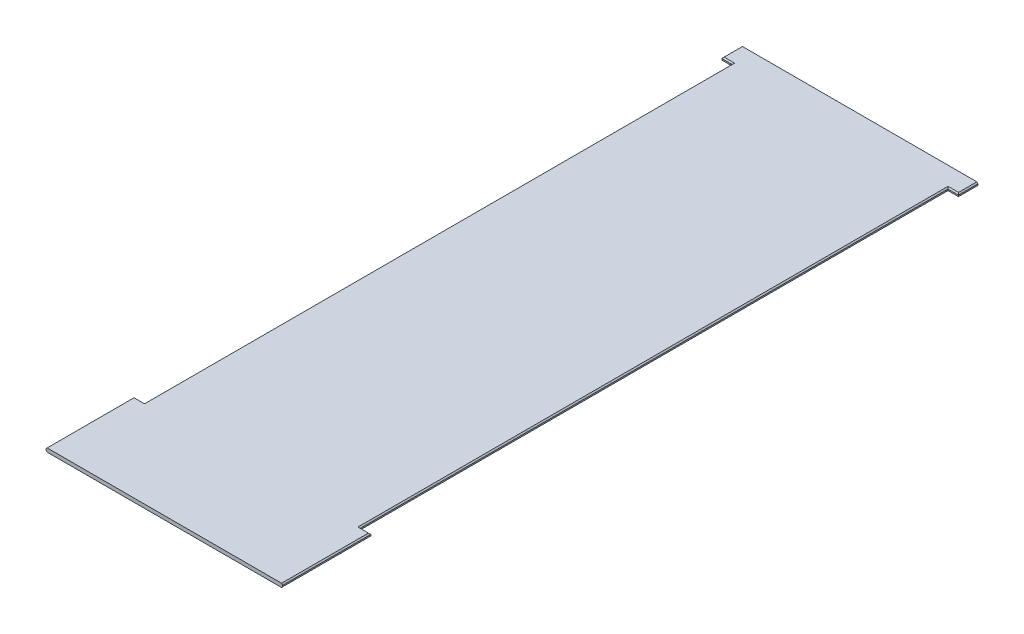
ISO-10303-21;
HEADER;
FILE_DESCRIPTION(('STEP AP214'),'2;1');
FILE_NAME('part.step','',(''),(''),'','','');
FILE_SCHEMA(('AUTOMOTIVE_DESIGN { 1 0 10303 214 1 1 1 1 }'));
ENDSEC;
DATA;
#1=APPLICATION_CONTEXT('core data for automotive mechanical design processes');
#2=APPLICATION_PROTOCOL_DEFINITION('international standard','automotive_design',2000,#1);
#3=PRODUCT_CONTEXT('',#1,'mechanical');
#4=PRODUCT('Part','Part','',(#3));
#5=PRODUCT_RELATED_PRODUCT_CATEGORY('part','',(#4));
#6=PRODUCT_DEFINITION_FORMATION('','',#4);
#7=PRODUCT_DEFINITION_CONTEXT('part definition',#1,'design');
#8=PRODUCT_DEFINITION('design','',#6,#7);
#9=PRODUCT_DEFINITION_SHAPE('','',#8);
#10=(LENGTH_UNIT() NAMED_UNIT(*) SI_UNIT(.MILLI.,.METRE.));
#11=(NAMED_UNIT(*) PLANE_ANGLE_UNIT() SI_UNIT($,.RADIAN.));
#12=(NAMED_UNIT(*) SI_UNIT($,.STERADIAN.) SOLID_ANGLE_UNIT());
#13=UNCERTAINTY_MEASURE_WITH_UNIT(LENGTH_MEASURE(1.E-05),#10,'distance_accuracy_value','');
#14=(GEOMETRIC_REPRESENTATION_CONTEXT(3) GLOBAL_UNCERTAINTY_ASSIGNED_CONTEXT((#13)) GLOBAL_UNIT_ASSIGNED_CONTEXT((#10,
#11,#12)) REPRESENTATION_CONTEXT('',''));
#15=CARTESIAN_POINT('',(0.,0.,0.));
#16=DIRECTION('',(0.,0.,1.));
#17=DIRECTION('',(1.,0.,0.));
#18=AXIS2_PLACEMENT_3D('',#15,#16,#17);
#19=CARTESIAN_POINT('',(553.261641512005,9.525,1566.92811259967));
#20=DIRECTION('',(-1.,0.,0.));
#21=DIRECTION('',(0.,0.,1.));
#22=AXIS2_PLACEMENT_3D('',#19,#20,#21);
#23=PLANE('',#22);
#24=DIRECTION('',(0.,-1.,0.));
#25=VECTOR('',#24,1.);
#26=CARTESIAN_POINT('',(553.261641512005,9.525,2018.12811259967));
#27=LINE('',#26,#25);
#28=CARTESIAN_POINT('',(553.261641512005,3.52500000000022,2018.12811259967));
#29=VERTEX_POINT('',#28);
#30=CARTESIAN_POINT('',(553.261641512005,-3.52499999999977,2018.12811259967));
#31=VERTEX_POINT('',#30);
#32=EDGE_CURVE('E236',#29,#31,#27,.T.);
#33=ORIENTED_EDGE('',*,*,#32,.T.);
#34=DIRECTION('',(0.,0.,-1.));
#35=VECTOR('',#34,1.);
#36=CARTESIAN_POINT('',(553.261641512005,-3.52499999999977,1566.92811259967));
#37=LINE('',#36,#35);
#38=CARTESIAN_POINT('',(553.261641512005,-3.52499999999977,1566.92811259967));
#39=VERTEX_POINT('',#38);
#40=EDGE_CURVE('E11',#31,#39,#37,.T.);
#41=ORIENTED_EDGE('',*,*,#40,.T.);
#42=DIRECTION('',(0.,-1.,0.));
#43=VECTOR('',#42,1.);
#44=CARTESIAN_POINT('',(553.261641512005,9.525,1566.92811259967));
#45=LINE('',#44,#43);
#46=CARTESIAN_POINT('',(553.261641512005,3.52500000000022,1566.92811259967));
#47=VERTEX_POINT('',#46);
#48=EDGE_CURVE('E243',#47,#39,#45,.T.);
#49=ORIENTED_EDGE('',*,*,#48,.F.);
#50=DIRECTION('',(0.,0.,1.));
#51=VECTOR('',#50,1.);
#52=CARTESIAN_POINT('',(553.261641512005,3.52500000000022,1566.92811259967));
#53=LINE('',#52,#51);
#54=EDGE_CURVE('E59',#47,#29,#53,.T.);
#55=ORIENTED_EDGE('',*,*,#54,.T.);
#56=EDGE_LOOP('',(#33,#41,#49,#55));
#57=FACE_BOUND('',#56,.T.);
#58=ADVANCED_FACE('F50',(#57),#23,.F.);
#59=CARTESIAN_POINT('',(499.461641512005,9.525,1566.92811259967));
#60=DIRECTION('',(0.,0.,1.));
#61=DIRECTION('',(1.,0.,0.));
#62=AXIS2_PLACEMENT_3D('',#59,#60,#61);
#63=PLANE('',#62);
#64=ORIENTED_EDGE('',*,*,#48,.T.);
#65=DIRECTION('',(-1.,0.,0.));
#66=VECTOR('',#65,1.);
#67=CARTESIAN_POINT('',(499.461641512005,-3.52499999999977,1566.92811259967));
#68=LINE('',#67,#66);
#69=CARTESIAN_POINT('',(499.461641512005,-3.52499999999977,1566.92811259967));
#70=VERTEX_POINT('',#69);
#71=EDGE_CURVE('E380',#39,#70,#68,.T.);
#72=ORIENTED_EDGE('',*,*,#71,.T.);
#73=DIRECTION('',(0.,-1.,0.));
#74=VECTOR('',#73,1.);
#75=CARTESIAN_POINT('',(499.461641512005,9.525,1566.92811259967));
#76=LINE('',#75,#74);
#77=CARTESIAN_POINT('',(499.461641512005,3.52500000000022,1566.92811259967));
#78=VERTEX_POINT('',#77);
#79=EDGE_CURVE('E248',#78,#70,#76,.T.);
#80=ORIENTED_EDGE('',*,*,#79,.F.);
#81=DIRECTION('',(1.,0.,0.));
#82=VECTOR('',#81,1.);
#83=CARTESIAN_POINT('',(499.461641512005,3.52500000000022,1566.92811259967));
#84=LINE('',#83,#82);
#85=EDGE_CURVE('E72',#78,#47,#84,.T.);
#86=ORIENTED_EDGE('',*,*,#85,.T.);
#87=EDGE_LOOP('',(#64,#72,#80,#86));
#88=FACE_BOUND('',#87,.T.);
#89=ADVANCED_FACE('F620',(#88),#63,.F.);
#90=CARTESIAN_POINT('',(499.461641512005,9.525,-1445.07188740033));
#91=DIRECTION('',(-1.,0.,0.));
#92=DIRECTION('',(0.,0.,1.));
#93=AXIS2_PLACEMENT_3D('',#90,#91,#92);
#94=PLANE('',#93);
#95=ORIENTED_EDGE('',*,*,#79,.T.);
#96=DIRECTION('',(0.,0.,-1.));
#97=VECTOR('',#96,1.);
#98=CARTESIAN_POINT('',(499.461641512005,-3.52499999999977,-1445.07188740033));
#99=LINE('',#98,#97);
#100=CARTESIAN_POINT('',(499.461641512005,-3.52499999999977,-1445.07188740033));
#101=VERTEX_POINT('',#100);
#102=EDGE_CURVE('E375',#70,#101,#99,.T.);
#103=ORIENTED_EDGE('',*,*,#102,.T.);
#104=DIRECTION('',(0.,-1.,0.));
#105=VECTOR('',#104,1.);
#106=CARTESIAN_POINT('',(499.461641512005,9.525,-1445.07188740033));
#107=LINE('',#106,#105);
#108=CARTESIAN_POINT('',(499.461641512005,3.52500000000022,-1445.07188740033));
#109=VERTEX_POINT('',#108);
#110=EDGE_CURVE('E493',#109,#101,#107,.T.);
#111=ORIENTED_EDGE('',*,*,#110,.F.);
#112=DIRECTION('',(0.,0.,1.));
#113=VECTOR('',#112,1.);
#114=CARTESIAN_POINT('',(499.461641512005,3.52500000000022,-1445.07188740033));
#115=LINE('',#114,#113);
#116=EDGE_CURVE('E367',#109,#78,#115,.T.);
#117=ORIENTED_EDGE('',*,*,#116,.T.);
#118=EDGE_LOOP('',(#95,#103,#111,#117));
#119=FACE_BOUND('',#118,.T.);
#120=ADVANCED_FACE('F498',(#119),#94,.F.);
#121=CARTESIAN_POINT('',(499.461641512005,9.525,-1445.07188740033));
#122=DIRECTION('',(0.,0.,-1.));
#123=DIRECTION('',(-1.,0.,0.));
#124=AXIS2_PLACEMENT_3D('',#121,#122,#123);
#125=PLANE('',#124);
#126=ORIENTED_EDGE('',*,*,#110,.T.);
#127=DIRECTION('',(1.,0.,0.));
#128=VECTOR('',#127,1.);
#129=CARTESIAN_POINT('',(553.261641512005,-3.52499999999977,-1445.07188740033));
#130=LINE('',#129,#128);
#131=CARTESIAN_POINT('',(553.261641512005,-3.52499999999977,-1445.07188740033));
#132=VERTEX_POINT('',#131);
#133=EDGE_CURVE('E366',#101,#132,#130,.T.);
#134=ORIENTED_EDGE('',*,*,#133,.T.);
#135=DIRECTION('',(0.,-1.,0.));
#136=VECTOR('',#135,1.);
#137=CARTESIAN_POINT('',(553.261641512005,9.525,-1445.07188740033));
#138=LINE('',#137,#136);
#139=CARTESIAN_POINT('',(553.261641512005,3.52500000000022,-1445.07188740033));
#140=VERTEX_POINT('',#139);
#141=EDGE_CURVE('E487',#140,#132,#138,.T.);
#142=ORIENTED_EDGE('',*,*,#141,.F.);
#143=DIRECTION('',(-1.,0.,0.));
#144=VECTOR('',#143,1.);
#145=CARTESIAN_POINT('',(499.461641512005,3.52500000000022,-1445.07188740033));
#146=LINE('',#145,#144);
#147=EDGE_CURVE('E361',#140,#109,#146,.T.);
#148=ORIENTED_EDGE('',*,*,#147,.T.);
#149=EDGE_LOOP('',(#126,#134,#142,#148));
#150=FACE_BOUND('',#149,.T.);
#151=ADVANCED_FACE('F520',(#150),#125,.F.);
#152=CARTESIAN_POINT('',(553.261641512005,9.525,-1445.07188740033));
#153=DIRECTION('',(-1.,0.,0.));
#154=DIRECTION('',(0.,0.,1.));
#155=AXIS2_PLACEMENT_3D('',#152,#153,#154);
#156=PLANE('',#155);
#157=ORIENTED_EDGE('',*,*,#141,.T.);
#158=DIRECTION('',(0.,0.,-1.));
#159=VECTOR('',#158,1.);
#160=CARTESIAN_POINT('',(553.261641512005,-3.52499999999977,-1545.0718874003));
#161=LINE('',#160,#159);
#162=CARTESIAN_POINT('',(553.261641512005,-3.52499999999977,-1545.0718874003));
#163=VERTEX_POINT('',#162);
#164=EDGE_CURVE('E360',#132,#163,#161,.T.);
#165=ORIENTED_EDGE('',*,*,#164,.T.);
#166=DIRECTION('',(0.,-1.,0.));
#167=VECTOR('',#166,1.);
#168=CARTESIAN_POINT('',(553.261641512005,9.525,-1545.0718874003));
#169=LINE('',#168,#167);
#170=CARTESIAN_POINT('',(553.261641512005,3.52500000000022,-1545.0718874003));
#171=VERTEX_POINT('',#170);
#172=EDGE_CURVE('E484',#171,#163,#169,.T.);
#173=ORIENTED_EDGE('',*,*,#172,.F.);
#174=DIRECTION('',(0.,0.,1.));
#175=VECTOR('',#174,1.);
#176=CARTESIAN_POINT('',(553.261641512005,3.52500000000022,-1445.07188740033));
#177=LINE('',#176,#175);
#178=EDGE_CURVE('E358',#171,#140,#177,.T.);
#179=ORIENTED_EDGE('',*,*,#178,.T.);
#180=EDGE_LOOP('',(#157,#165,#173,#179));
#181=FACE_BOUND('',#180,.T.);
#182=ADVANCED_FACE('F518',(#181),#156,.F.);
#183=CARTESIAN_POINT('',(-659.938358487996,9.525,-1545.0718874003));
#184=DIRECTION('',(0.,0.,1.));
#185=DIRECTION('',(1.,0.,0.));
#186=AXIS2_PLACEMENT_3D('',#183,#184,#185);
#187=PLANE('',#186);
#188=DIRECTION('',(-1.,0.,0.));
#189=VECTOR('',#188,1.);
#190=CARTESIAN_POINT('',(-659.938358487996,-9.525,-1545.0718874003));
#191=LINE('',#190,#189);
#192=CARTESIAN_POINT('',(547.261641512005,-9.525,-1545.0718874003));
#193=VERTEX_POINT('',#192);
#194=CARTESIAN_POINT('',(-653.938358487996,-9.525,-1545.0718874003));
#195=VERTEX_POINT('',#194);
#196=EDGE_CURVE('E396',#193,#195,#191,.T.);
#197=ORIENTED_EDGE('',*,*,#196,.T.);
#198=DIRECTION('',(-0.707106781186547,0.707106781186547,0.));
#199=VECTOR('',#198,1.);
#200=CARTESIAN_POINT('',(-659.938358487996,-3.52499999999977,-1545.0718874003));
#201=LINE('',#200,#199);
#202=CARTESIAN_POINT('',(-659.938358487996,-3.52499999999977,-1545.0718874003));
#203=VERTEX_POINT('',#202);
#204=EDGE_CURVE('E325',#195,#203,#201,.T.);
#205=ORIENTED_EDGE('',*,*,#204,.T.);
#206=DIRECTION('',(0.,-1.,0.));
#207=VECTOR('',#206,1.);
#208=CARTESIAN_POINT('',(-659.938358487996,9.525,-1545.0718874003));
#209=LINE('',#208,#207);
#210=CARTESIAN_POINT('',(-659.938358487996,3.52500000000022,-1545.0718874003));
#211=VERTEX_POINT('',#210);
#212=EDGE_CURVE('E478',#211,#203,#209,.T.);
#213=ORIENTED_EDGE('',*,*,#212,.F.);
#214=DIRECTION('',(-0.707106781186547,-0.707106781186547,0.));
#215=VECTOR('',#214,1.);
#216=CARTESIAN_POINT('',(-653.938358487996,9.525,-1545.0718874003));
#217=LINE('',#216,#215);
#218=CARTESIAN_POINT('',(-653.938358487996,9.525,-1545.0718874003));
#219=VERTEX_POINT('',#218);
#220=EDGE_CURVE('E316',#211,#219,#217,.F.);
#221=ORIENTED_EDGE('',*,*,#220,.T.);
#222=DIRECTION('',(-1.,0.,0.));
#223=VECTOR('',#222,1.);
#224=CARTESIAN_POINT('',(-659.938358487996,9.525,-1545.0718874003));
#225=LINE('',#224,#223);
#226=CARTESIAN_POINT('',(547.261641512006,9.525,-1545.0718874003));
#227=VERTEX_POINT('',#226);
#228=EDGE_CURVE('E458',#227,#219,#225,.T.);
#229=ORIENTED_EDGE('',*,*,#228,.F.);
#230=DIRECTION('',(-0.707106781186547,0.707106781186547,0.));
#231=VECTOR('',#230,1.);
#232=CARTESIAN_POINT('',(547.261641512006,9.525,-1545.0718874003));
#233=LINE('',#232,#231);
#234=EDGE_CURVE('E312',#227,#171,#233,.F.);
#235=ORIENTED_EDGE('',*,*,#234,.T.);
#236=ORIENTED_EDGE('',*,*,#172,.T.);
#237=DIRECTION('',(-0.707106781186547,-0.707106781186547,0.));
#238=VECTOR('',#237,1.);
#239=CARTESIAN_POINT('',(553.261641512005,-3.52499999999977,-1545.0718874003));
#240=LINE('',#239,#238);
#241=EDGE_CURVE('E317',#163,#193,#240,.T.);
#242=ORIENTED_EDGE('',*,*,#241,.T.);
#243=EDGE_LOOP('',(#197,#205,#213,#221,#229,#235,#236,#242));
#244=FACE_BOUND('',#243,.T.);
#245=ADVANCED_FACE('F573',(#244),#187,.F.);
#246=CARTESIAN_POINT('',(-659.938358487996,9.525,-1445.07188740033));
#247=DIRECTION('',(1.,0.,0.));
#248=DIRECTION('',(0.,0.,-1.));
#249=AXIS2_PLACEMENT_3D('',#246,#247,#248);
#250=PLANE('',#249);
#251=ORIENTED_EDGE('',*,*,#212,.T.);
#252=DIRECTION('',(0.,0.,1.));
#253=VECTOR('',#252,1.);
#254=CARTESIAN_POINT('',(-659.938358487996,-3.52499999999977,-1445.07188740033));
#255=LINE('',#254,#253);
#256=CARTESIAN_POINT('',(-659.938358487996,-3.52499999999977,-1445.07188740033));
#257=VERTEX_POINT('',#256);
#258=EDGE_CURVE('E309',#203,#257,#255,.T.);
#259=ORIENTED_EDGE('',*,*,#258,.T.);
#260=DIRECTION('',(0.,-1.,0.));
#261=VECTOR('',#260,1.);
#262=CARTESIAN_POINT('',(-659.938358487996,9.525,-1445.07188740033));
#263=LINE('',#262,#261);
#264=CARTESIAN_POINT('',(-659.938358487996,3.52500000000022,-1445.07188740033));
#265=VERTEX_POINT('',#264);
#266=EDGE_CURVE('E473',#265,#257,#263,.T.);
#267=ORIENTED_EDGE('',*,*,#266,.F.);
#268=DIRECTION('',(0.,0.,-1.));
#269=VECTOR('',#268,1.);
#270=CARTESIAN_POINT('',(-659.938358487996,3.52500000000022,-1445.07188740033));
#271=LINE('',#270,#269);
#272=EDGE_CURVE('E310',#265,#211,#271,.T.);
#273=ORIENTED_EDGE('',*,*,#272,.T.);
#274=EDGE_LOOP('',(#251,#259,#267,#273));
#275=FACE_BOUND('',#274,.T.);
#276=ADVANCED_FACE('F563',(#275),#250,.F.);
#277=CARTESIAN_POINT('',(-606.138358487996,9.525,-1445.07188740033));
#278=DIRECTION('',(0.,0.,-1.));
#279=DIRECTION('',(-1.,0.,0.));
#280=AXIS2_PLACEMENT_3D('',#277,#278,#279);
#281=PLANE('',#280);
#282=ORIENTED_EDGE('',*,*,#266,.T.);
#283=DIRECTION('',(1.,0.,0.));
#284=VECTOR('',#283,1.);
#285=CARTESIAN_POINT('',(-606.138358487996,-3.52499999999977,-1445.07188740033));
#286=LINE('',#285,#284);
#287=CARTESIAN_POINT('',(-606.138358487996,-3.52499999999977,-1445.07188740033));
#288=VERTEX_POINT('',#287);
#289=EDGE_CURVE('E302',#257,#288,#286,.T.);
#290=ORIENTED_EDGE('',*,*,#289,.T.);
#291=DIRECTION('',(0.,-1.,0.));
#292=VECTOR('',#291,1.);
#293=CARTESIAN_POINT('',(-606.138358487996,9.525,-1445.07188740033));
#294=LINE('',#293,#292);
#295=CARTESIAN_POINT('',(-606.138358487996,3.52500000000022,-1445.07188740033));
#296=VERTEX_POINT('',#295);
#297=EDGE_CURVE('E472',#296,#288,#294,.T.);
#298=ORIENTED_EDGE('',*,*,#297,.F.);
#299=DIRECTION('',(-1.,0.,0.));
#300=VECTOR('',#299,1.);
#301=CARTESIAN_POINT('',(-606.138358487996,3.52500000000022,-1445.07188740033));
#302=LINE('',#301,#300);
#303=EDGE_CURVE('E301',#296,#265,#302,.T.);
#304=ORIENTED_EDGE('',*,*,#303,.T.);
#305=EDGE_LOOP('',(#282,#290,#298,#304));
#306=FACE_BOUND('',#305,.T.);
#307=ADVANCED_FACE('F559',(#306),#281,.F.);
#308=CARTESIAN_POINT('',(-606.138358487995,9.525,1566.92811259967));
#309=DIRECTION('',(1.,0.,0.));
#310=DIRECTION('',(0.,0.,-1.));
#311=AXIS2_PLACEMENT_3D('',#308,#309,#310);
#312=PLANE('',#311);
#313=ORIENTED_EDGE('',*,*,#297,.T.);
#314=DIRECTION('',(0.,0.,1.));
#315=VECTOR('',#314,1.);
#316=CARTESIAN_POINT('',(-606.138358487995,-3.52499999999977,1566.92811259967));
#317=LINE('',#316,#315);
#318=CARTESIAN_POINT('',(-606.138358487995,-3.52499999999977,1566.92811259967));
#319=VERTEX_POINT('',#318);
#320=EDGE_CURVE('E296',#288,#319,#317,.T.);
#321=ORIENTED_EDGE('',*,*,#320,.T.);
#322=DIRECTION('',(0.,-1.,0.));
#323=VECTOR('',#322,1.);
#324=CARTESIAN_POINT('',(-606.138358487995,9.525,1566.92811259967));
#325=LINE('',#324,#323);
#326=CARTESIAN_POINT('',(-606.138358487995,3.52500000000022,1566.92811259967));
#327=VERTEX_POINT('',#326);
#328=EDGE_CURVE('E470',#327,#319,#325,.T.);
#329=ORIENTED_EDGE('',*,*,#328,.F.);
#330=DIRECTION('',(0.,0.,-1.));
#331=VECTOR('',#330,1.);
#332=CARTESIAN_POINT('',(-606.138358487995,3.52500000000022,1566.92811259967));
#333=LINE('',#332,#331);
#334=EDGE_CURVE('E294',#327,#296,#333,.T.);
#335=ORIENTED_EDGE('',*,*,#334,.T.);
#336=EDGE_LOOP('',(#313,#321,#329,#335));
#337=FACE_BOUND('',#336,.T.);
#338=ADVANCED_FACE('F547',(#337),#312,.F.);
#339=CARTESIAN_POINT('',(-659.938358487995,9.525,1566.92811259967));
#340=DIRECTION('',(0.,0.,1.));
#341=DIRECTION('',(1.,0.,0.));
#342=AXIS2_PLACEMENT_3D('',#339,#340,#341);
#343=PLANE('',#342);
#344=ORIENTED_EDGE('',*,*,#328,.T.);
#345=DIRECTION('',(-1.,0.,0.));
#346=VECTOR('',#345,1.);
#347=CARTESIAN_POINT('',(-659.938358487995,-3.52499999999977,1566.92811259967));
#348=LINE('',#347,#346);
#349=CARTESIAN_POINT('',(-659.938358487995,-3.52499999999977,1566.92811259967));
#350=VERTEX_POINT('',#349);
#351=EDGE_CURVE('E292',#319,#350,#348,.T.);
#352=ORIENTED_EDGE('',*,*,#351,.T.);
#353=DIRECTION('',(0.,-1.,0.));
#354=VECTOR('',#353,1.);
#355=CARTESIAN_POINT('',(-659.938358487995,9.525,1566.92811259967));
#356=LINE('',#355,#354);
#357=CARTESIAN_POINT('',(-659.938358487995,3.52500000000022,1566.92811259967));
#358=VERTEX_POINT('',#357);
#359=EDGE_CURVE('E232',#358,#350,#356,.T.);
#360=ORIENTED_EDGE('',*,*,#359,.F.);
#361=DIRECTION('',(1.,0.,0.));
#362=VECTOR('',#361,1.);
#363=CARTESIAN_POINT('',(-659.938358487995,3.52500000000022,1566.92811259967));
#364=LINE('',#363,#362);
#365=EDGE_CURVE('E286',#358,#327,#364,.T.);
#366=ORIENTED_EDGE('',*,*,#365,.T.);
#367=EDGE_LOOP('',(#344,#352,#360,#366));
#368=FACE_BOUND('',#367,.T.);
#369=ADVANCED_FACE('F542',(#368),#343,.F.);
#370=CARTESIAN_POINT('',(-659.938358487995,9.525,2018.12811259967));
#371=DIRECTION('',(1.,0.,0.));
#372=DIRECTION('',(0.,0.,-1.));
#373=AXIS2_PLACEMENT_3D('',#370,#371,#372);
#374=PLANE('',#373);
#375=ORIENTED_EDGE('',*,*,#359,.T.);
#376=DIRECTION('',(0.,0.,1.));
#377=VECTOR('',#376,1.);
#378=CARTESIAN_POINT('',(-659.938358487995,-3.52499999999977,2018.12811259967));
#379=LINE('',#378,#377);
#380=CARTESIAN_POINT('',(-659.938358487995,-3.52499999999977,2018.12811259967));
#381=VERTEX_POINT('',#380);
#382=EDGE_CURVE('E231',#350,#381,#379,.T.);
#383=ORIENTED_EDGE('',*,*,#382,.T.);
#384=DIRECTION('',(0.,-1.,0.));
#385=VECTOR('',#384,1.);
#386=CARTESIAN_POINT('',(-659.938358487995,9.525,2018.12811259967));
#387=LINE('',#386,#385);
#388=CARTESIAN_POINT('',(-659.938358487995,3.52500000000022,2018.12811259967));
#389=VERTEX_POINT('',#388);
#390=EDGE_CURVE('E213',#389,#381,#387,.T.);
#391=ORIENTED_EDGE('',*,*,#390,.F.);
#392=DIRECTION('',(0.,0.,-1.));
#393=VECTOR('',#392,1.);
#394=CARTESIAN_POINT('',(-659.938358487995,3.52500000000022,2018.12811259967));
#395=LINE('',#394,#393);
#396=EDGE_CURVE('E229',#389,#358,#395,.T.);
#397=ORIENTED_EDGE('',*,*,#396,.T.);
#398=EDGE_LOOP('',(#375,#383,#391,#397));
#399=FACE_BOUND('',#398,.T.);
#400=ADVANCED_FACE('F230',(#399),#374,.F.);
#401=CARTESIAN_POINT('',(553.261641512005,9.525,2018.12811259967));
#402=DIRECTION('',(0.,0.,-1.));
#403=DIRECTION('',(-1.,0.,0.));
#404=AXIS2_PLACEMENT_3D('',#401,#402,#403);
#405=PLANE('',#404);
#406=ORIENTED_EDGE('',*,*,#390,.T.);
#407=DIRECTION('',(0.707106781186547,-0.707106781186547,0.));
#408=VECTOR('',#407,1.);
#409=CARTESIAN_POINT('',(-659.938358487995,-3.52499999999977,2018.12811259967));
#410=LINE('',#409,#408);
#411=CARTESIAN_POINT('',(-653.938358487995,-9.525,2018.12811259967));
#412=VERTEX_POINT('',#411);
#413=EDGE_CURVE('E224',#381,#412,#410,.T.);
#414=ORIENTED_EDGE('',*,*,#413,.T.);
#415=DIRECTION('',(1.,0.,0.));
#416=VECTOR('',#415,1.);
#417=CARTESIAN_POINT('',(553.261641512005,-9.525,2018.12811259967));
#418=LINE('',#417,#416);
#419=CARTESIAN_POINT('',(547.261641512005,-9.525,2018.12811259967));
#420=VERTEX_POINT('',#419);
#421=EDGE_CURVE('E465',#412,#420,#418,.T.);
#422=ORIENTED_EDGE('',*,*,#421,.T.);
#423=DIRECTION('',(0.707106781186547,0.707106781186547,0.));
#424=VECTOR('',#423,1.);
#425=CARTESIAN_POINT('',(553.261641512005,-3.52499999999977,2018.12811259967));
#426=LINE('',#425,#424);
#427=EDGE_CURVE('E221',#420,#31,#426,.T.);
#428=ORIENTED_EDGE('',*,*,#427,.T.);
#429=ORIENTED_EDGE('',*,*,#32,.F.);
#430=DIRECTION('',(0.707106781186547,-0.707106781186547,0.));
#431=VECTOR('',#430,1.);
#432=CARTESIAN_POINT('',(547.261641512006,9.525,2018.12811259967));
#433=LINE('',#432,#431);
#434=CARTESIAN_POINT('',(547.261641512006,9.525,2018.12811259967));
#435=VERTEX_POINT('',#434);
#436=EDGE_CURVE('E250',#29,#435,#433,.F.);
#437=ORIENTED_EDGE('',*,*,#436,.T.);
#438=DIRECTION('',(1.,0.,0.));
#439=VECTOR('',#438,1.);
#440=CARTESIAN_POINT('',(553.261641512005,9.525,2018.12811259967));
#441=LINE('',#440,#439);
#442=CARTESIAN_POINT('',(-653.938358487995,9.525,2018.12811259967));
#443=VERTEX_POINT('',#442);
#444=EDGE_CURVE('E217',#443,#435,#441,.T.);
#445=ORIENTED_EDGE('',*,*,#444,.F.);
#446=DIRECTION('',(0.707106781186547,0.707106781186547,0.));
#447=VECTOR('',#446,1.);
#448=CARTESIAN_POINT('',(-653.938358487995,9.525,2018.12811259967));
#449=LINE('',#448,#447);
#450=EDGE_CURVE('E215',#443,#389,#449,.F.);
#451=ORIENTED_EDGE('',*,*,#450,.T.);
#452=EDGE_LOOP('',(#406,#414,#422,#428,#429,#437,#445,#451));
#453=FACE_BOUND('',#452,.T.);
#454=ADVANCED_FACE('F211',(#453),#405,.F.);
#455=CARTESIAN_POINT('',(0.,9.525,0.));
#456=DIRECTION('',(0.,-1.,0.));
#457=DIRECTION('',(0.,0.,-1.));
#458=AXIS2_PLACEMENT_3D('',#455,#456,#457);
#459=PLANE('',#458);
#460=DIRECTION('',(-1.,0.,0.));
#461=VECTOR('',#460,1.);
#462=CARTESIAN_POINT('',(0.,9.525,1572.92811259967));
#463=LINE('',#462,#461);
#464=CARTESIAN_POINT('',(-600.138358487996,9.525,1572.92811259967));
#465=VERTEX_POINT('',#464);
#466=CARTESIAN_POINT('',(-653.938358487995,9.525,1572.92811259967));
#467=VERTEX_POINT('',#466);
#468=EDGE_CURVE('E350',#465,#467,#463,.T.);
#469=ORIENTED_EDGE('',*,*,#468,.T.);
#470=DIRECTION('',(0.,0.,1.));
#471=VECTOR('',#470,1.);
#472=CARTESIAN_POINT('',(-653.938358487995,9.525,0.));
#473=LINE('',#472,#471);
#474=EDGE_CURVE('E354',#467,#443,#473,.T.);
#475=ORIENTED_EDGE('',*,*,#474,.T.);
#476=ORIENTED_EDGE('',*,*,#444,.T.);
#477=DIRECTION('',(0.,0.,-1.));
#478=VECTOR('',#477,1.);
#479=CARTESIAN_POINT('',(547.261641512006,9.525,0.));
#480=LINE('',#479,#478);
#481=CARTESIAN_POINT('',(547.261641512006,9.525,1572.92811259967));
#482=VERTEX_POINT('',#481);
#483=EDGE_CURVE('E323',#435,#482,#480,.T.);
#484=ORIENTED_EDGE('',*,*,#483,.T.);
#485=DIRECTION('',(-1.,0.,0.));
#486=VECTOR('',#485,1.);
#487=CARTESIAN_POINT('',(0.,9.525,1572.92811259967));
#488=LINE('',#487,#486);
#489=CARTESIAN_POINT('',(493.461641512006,9.525,1572.92811259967));
#490=VERTEX_POINT('',#489);
#491=EDGE_CURVE('E329',#482,#490,#488,.T.);
#492=ORIENTED_EDGE('',*,*,#491,.T.);
#493=DIRECTION('',(0.,0.,-1.));
#494=VECTOR('',#493,1.);
#495=CARTESIAN_POINT('',(493.461641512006,9.525,0.));
#496=LINE('',#495,#494);
#497=CARTESIAN_POINT('',(493.461641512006,9.525,-1451.07188740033));
#498=VERTEX_POINT('',#497);
#499=EDGE_CURVE('E332',#490,#498,#496,.T.);
#500=ORIENTED_EDGE('',*,*,#499,.T.);
#501=DIRECTION('',(1.,0.,0.));
#502=VECTOR('',#501,1.);
#503=CARTESIAN_POINT('',(0.,9.525,-1451.07188740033));
#504=LINE('',#503,#502);
#505=CARTESIAN_POINT('',(547.261641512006,9.525,-1451.07188740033));
#506=VERTEX_POINT('',#505);
#507=EDGE_CURVE('E331',#498,#506,#504,.T.);
#508=ORIENTED_EDGE('',*,*,#507,.T.);
#509=DIRECTION('',(0.,0.,-1.));
#510=VECTOR('',#509,1.);
#511=CARTESIAN_POINT('',(547.261641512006,9.525,0.));
#512=LINE('',#511,#510);
#513=EDGE_CURVE('E340',#506,#227,#512,.T.);
#514=ORIENTED_EDGE('',*,*,#513,.T.);
#515=ORIENTED_EDGE('',*,*,#228,.T.);
#516=DIRECTION('',(0.,0.,1.));
#517=VECTOR('',#516,1.);
#518=CARTESIAN_POINT('',(-653.938358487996,9.525,0.));
#519=LINE('',#518,#517);
#520=CARTESIAN_POINT('',(-653.938358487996,9.525,-1451.07188740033));
#521=VERTEX_POINT('',#520);
#522=EDGE_CURVE('E342',#219,#521,#519,.T.);
#523=ORIENTED_EDGE('',*,*,#522,.T.);
#524=DIRECTION('',(1.,0.,0.));
#525=VECTOR('',#524,1.);
#526=CARTESIAN_POINT('',(0.,9.525,-1451.07188740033));
#527=LINE('',#526,#525);
#528=CARTESIAN_POINT('',(-600.138358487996,9.525,-1451.07188740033));
#529=VERTEX_POINT('',#528);
#530=EDGE_CURVE('E341',#521,#529,#527,.T.);
#531=ORIENTED_EDGE('',*,*,#530,.T.);
#532=DIRECTION('',(0.,0.,1.));
#533=VECTOR('',#532,1.);
#534=CARTESIAN_POINT('',(-600.138358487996,9.525,0.));
#535=LINE('',#534,#533);
#536=EDGE_CURVE('E347',#529,#465,#535,.T.);
#537=ORIENTED_EDGE('',*,*,#536,.T.);
#538=EDGE_LOOP('',(#469,#475,#476,#484,#492,#500,#508,#514,#515,#523,#531,#537));
#539=FACE_BOUND('',#538,.T.);
#540=ADVANCED_FACE('F531',(#539),#459,.F.);
#541=CARTESIAN_POINT('',(0.,-9.525,0.));
#542=DIRECTION('',(0.,-1.,0.));
#543=DIRECTION('',(0.,0.,-1.));
#544=AXIS2_PLACEMENT_3D('',#541,#542,#543);
#545=PLANE('',#544);
#546=ORIENTED_EDGE('',*,*,#421,.F.);
#547=DIRECTION('',(0.,0.,-1.));
#548=VECTOR('',#547,1.);
#549=CARTESIAN_POINT('',(-653.938358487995,-9.525,1566.92811259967));
#550=LINE('',#549,#548);
#551=CARTESIAN_POINT('',(-653.938358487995,-9.525,1572.92811259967));
#552=VERTEX_POINT('',#551);
#553=EDGE_CURVE('E287',#412,#552,#550,.T.);
#554=ORIENTED_EDGE('',*,*,#553,.T.);
#555=DIRECTION('',(1.,0.,0.));
#556=VECTOR('',#555,1.);
#557=CARTESIAN_POINT('',(-606.138358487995,-9.525,1572.92811259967));
#558=LINE('',#557,#556);
#559=CARTESIAN_POINT('',(-600.138358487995,-9.525,1572.92811259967));
#560=VERTEX_POINT('',#559);
#561=EDGE_CURVE('E284',#552,#560,#558,.T.);
#562=ORIENTED_EDGE('',*,*,#561,.T.);
#563=DIRECTION('',(0.,0.,-1.));
#564=VECTOR('',#563,1.);
#565=CARTESIAN_POINT('',(-600.138358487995,-9.525,-1445.07188740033));
#566=LINE('',#565,#564);
#567=CARTESIAN_POINT('',(-600.138358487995,-9.525,-1451.07188740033));
#568=VERTEX_POINT('',#567);
#569=EDGE_CURVE('E278',#560,#568,#566,.T.);
#570=ORIENTED_EDGE('',*,*,#569,.T.);
#571=DIRECTION('',(-1.,0.,0.));
#572=VECTOR('',#571,1.);
#573=CARTESIAN_POINT('',(-659.938358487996,-9.525,-1451.07188740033));
#574=LINE('',#573,#572);
#575=CARTESIAN_POINT('',(-653.938358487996,-9.525,-1451.07188740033));
#576=VERTEX_POINT('',#575);
#577=EDGE_CURVE('E280',#568,#576,#574,.T.);
#578=ORIENTED_EDGE('',*,*,#577,.T.);
#579=DIRECTION('',(0.,0.,-1.));
#580=VECTOR('',#579,1.);
#581=CARTESIAN_POINT('',(-653.938358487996,-9.525,-1545.0718874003));
#582=LINE('',#581,#580);
#583=EDGE_CURVE('E274',#576,#195,#582,.T.);
#584=ORIENTED_EDGE('',*,*,#583,.T.);
#585=ORIENTED_EDGE('',*,*,#196,.F.);
#586=DIRECTION('',(0.,0.,1.));
#587=VECTOR('',#586,1.);
#588=CARTESIAN_POINT('',(547.261641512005,-9.525,-1445.07188740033));
#589=LINE('',#588,#587);
#590=CARTESIAN_POINT('',(547.261641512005,-9.525,-1451.07188740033));
#591=VERTEX_POINT('',#590);
#592=EDGE_CURVE('E272',#193,#591,#589,.T.);
#593=ORIENTED_EDGE('',*,*,#592,.T.);
#594=DIRECTION('',(-1.,0.,0.));
#595=VECTOR('',#594,1.);
#596=CARTESIAN_POINT('',(499.461641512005,-9.525,-1451.07188740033));
#597=LINE('',#596,#595);
#598=CARTESIAN_POINT('',(493.461641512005,-9.525,-1451.07188740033));
#599=VERTEX_POINT('',#598);
#600=EDGE_CURVE('E269',#591,#599,#597,.T.);
#601=ORIENTED_EDGE('',*,*,#600,.T.);
#602=DIRECTION('',(0.,0.,1.));
#603=VECTOR('',#602,1.);
#604=CARTESIAN_POINT('',(493.461641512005,-9.525,1566.92811259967));
#605=LINE('',#604,#603);
#606=CARTESIAN_POINT('',(493.461641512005,-9.525,1572.92811259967));
#607=VERTEX_POINT('',#606);
#608=EDGE_CURVE('E265',#599,#607,#605,.T.);
#609=ORIENTED_EDGE('',*,*,#608,.T.);
#610=DIRECTION('',(1.,0.,0.));
#611=VECTOR('',#610,1.);
#612=CARTESIAN_POINT('',(553.261641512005,-9.525,1572.92811259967));
#613=LINE('',#612,#611);
#614=CARTESIAN_POINT('',(547.261641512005,-9.525,1572.92811259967));
#615=VERTEX_POINT('',#614);
#616=EDGE_CURVE('E262',#607,#615,#613,.T.);
#617=ORIENTED_EDGE('',*,*,#616,.T.);
#618=DIRECTION('',(0.,0.,1.));
#619=VECTOR('',#618,1.);
#620=CARTESIAN_POINT('',(547.261641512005,-9.525,2018.12811259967));
#621=LINE('',#620,#619);
#622=EDGE_CURVE('E256',#615,#420,#621,.T.);
#623=ORIENTED_EDGE('',*,*,#622,.T.);
#624=EDGE_LOOP('',(#546,#554,#562,#570,#578,#584,#585,#593,#601,#609,#617,#623));
#625=FACE_BOUND('',#624,.T.);
#626=ADVANCED_FACE('F604',(#625),#545,.T.);
#627=CARTESIAN_POINT('',(-659.938358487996,-3.52499999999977,-1445.07188740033));
#628=DIRECTION('',(-0.707106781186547,-0.707106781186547,0.));
#629=DIRECTION('',(0.,0.,-1.));
#630=AXIS2_PLACEMENT_3D('',#627,#628,#629);
#631=PLANE('',#630);
#632=ORIENTED_EDGE('',*,*,#204,.F.);
#633=ORIENTED_EDGE('',*,*,#583,.F.);
#634=DIRECTION('',(-0.577350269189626,0.577350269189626,0.577350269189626));
#635=VECTOR('',#634,1.);
#636=CARTESIAN_POINT('',(-659.938358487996,-3.52499999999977,-1445.07188740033));
#637=LINE('',#636,#635);
#638=EDGE_CURVE('E395',#257,#576,#637,.F.);
#639=ORIENTED_EDGE('',*,*,#638,.F.);
#640=ORIENTED_EDGE('',*,*,#258,.F.);
#641=EDGE_LOOP('',(#632,#633,#639,#640));
#642=FACE_BOUND('',#641,.T.);
#643=ADVANCED_FACE('F583',(#642),#631,.T.);
#644=CARTESIAN_POINT('',(-606.138358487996,-3.52499999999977,-1445.07188740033));
#645=DIRECTION('',(0.,-0.707106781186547,0.707106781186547));
#646=DIRECTION('',(-1.,0.,0.));
#647=AXIS2_PLACEMENT_3D('',#644,#645,#646);
#648=PLANE('',#647);
#649=ORIENTED_EDGE('',*,*,#638,.T.);
#650=ORIENTED_EDGE('',*,*,#577,.F.);
#651=DIRECTION('',(-0.577350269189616,0.577350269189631,0.577350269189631));
#652=VECTOR('',#651,1.);
#653=CARTESIAN_POINT('',(-1610.13835848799,1000.47500000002,-441.071887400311));
#654=LINE('',#653,#652);
#655=EDGE_CURVE('E391',#288,#568,#654,.F.);
#656=ORIENTED_EDGE('',*,*,#655,.F.);
#657=ORIENTED_EDGE('',*,*,#289,.F.);
#658=EDGE_LOOP('',(#649,#650,#656,#657));
#659=FACE_BOUND('',#658,.T.);
#660=ADVANCED_FACE('F590',(#659),#648,.T.);
#661=CARTESIAN_POINT('',(-606.138358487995,-3.52499999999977,1566.92811259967));
#662=DIRECTION('',(-0.707106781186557,-0.707106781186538,0.));
#663=DIRECTION('',(0.,0.,-1.));
#664=AXIS2_PLACEMENT_3D('',#661,#662,#663);
#665=PLANE('',#664);
#666=ORIENTED_EDGE('',*,*,#655,.T.);
#667=ORIENTED_EDGE('',*,*,#569,.F.);
#668=DIRECTION('',(-0.577350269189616,0.577350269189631,-0.577350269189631));
#669=VECTOR('',#668,1.);
#670=CARTESIAN_POINT('',(-624.071691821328,14.4083333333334,1548.99477926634));
#671=LINE('',#670,#669);
#672=EDGE_CURVE('E387',#319,#560,#671,.F.);
#673=ORIENTED_EDGE('',*,*,#672,.F.);
#674=ORIENTED_EDGE('',*,*,#320,.F.);
#675=EDGE_LOOP('',(#666,#667,#673,#674));
#676=FACE_BOUND('',#675,.T.);
#677=ADVANCED_FACE('F594',(#676),#665,.T.);
#678=CARTESIAN_POINT('',(-659.938358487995,-3.52499999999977,1566.92811259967));
#679=DIRECTION('',(0.,-0.707106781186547,-0.707106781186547));
#680=DIRECTION('',(1.,0.,0.));
#681=AXIS2_PLACEMENT_3D('',#678,#679,#680);
#682=PLANE('',#681);
#683=ORIENTED_EDGE('',*,*,#672,.T.);
#684=ORIENTED_EDGE('',*,*,#561,.F.);
#685=DIRECTION('',(-0.577350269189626,0.577350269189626,-0.577350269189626));
#686=VECTOR('',#685,1.);
#687=CARTESIAN_POINT('',(-659.938358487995,-3.52499999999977,1566.92811259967));
#688=LINE('',#687,#686);
#689=EDGE_CURVE('E385',#350,#552,#688,.F.);
#690=ORIENTED_EDGE('',*,*,#689,.F.);
#691=ORIENTED_EDGE('',*,*,#351,.F.);
#692=EDGE_LOOP('',(#683,#684,#690,#691));
#693=FACE_BOUND('',#692,.T.);
#694=ADVANCED_FACE('F596',(#693),#682,.T.);
#695=CARTESIAN_POINT('',(-659.938358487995,-3.52499999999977,2018.12811259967));
#696=DIRECTION('',(-0.707106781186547,-0.707106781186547,0.));
#697=DIRECTION('',(0.,0.,-1.));
#698=AXIS2_PLACEMENT_3D('',#695,#696,#697);
#699=PLANE('',#698);
#700=ORIENTED_EDGE('',*,*,#689,.T.);
#701=ORIENTED_EDGE('',*,*,#553,.F.);
#702=ORIENTED_EDGE('',*,*,#413,.F.);
#703=ORIENTED_EDGE('',*,*,#382,.F.);
#704=EDGE_LOOP('',(#700,#701,#702,#703));
#705=FACE_BOUND('',#704,.T.);
#706=ADVANCED_FACE('F602',(#705),#699,.T.);
#707=CARTESIAN_POINT('',(-653.938358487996,9.525,0.));
#708=DIRECTION('',(0.707106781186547,-0.707106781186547,0.));
#709=DIRECTION('',(0.,0.,1.));
#710=AXIS2_PLACEMENT_3D('',#707,#708,#709);
#711=PLANE('',#710);
#712=ORIENTED_EDGE('',*,*,#220,.F.);
#713=ORIENTED_EDGE('',*,*,#272,.F.);
#714=DIRECTION('',(0.577350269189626,0.577350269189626,-0.577350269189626));
#715=VECTOR('',#714,1.);
#716=CARTESIAN_POINT('',(-1137.62898762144,-474.165629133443,-967.381258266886));
#717=LINE('',#716,#715);
#718=EDGE_CURVE('E390',#521,#265,#717,.F.);
#719=ORIENTED_EDGE('',*,*,#718,.F.);
#720=ORIENTED_EDGE('',*,*,#522,.F.);
#721=EDGE_LOOP('',(#712,#713,#719,#720));
#722=FACE_BOUND('',#721,.T.);
#723=ADVANCED_FACE('F568',(#722),#711,.F.);
#724=CARTESIAN_POINT('',(0.,9.525,-1451.07188740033));
#725=DIRECTION('',(0.,-0.707106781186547,-0.707106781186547));
#726=DIRECTION('',(1.,0.,0.));
#727=AXIS2_PLACEMENT_3D('',#724,#725,#726);
#728=PLANE('',#727);
#729=ORIENTED_EDGE('',*,*,#718,.T.);
#730=ORIENTED_EDGE('',*,*,#303,.F.);
#731=DIRECTION('',(0.577350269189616,0.577350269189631,-0.577350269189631));
#732=VECTOR('',#731,1.);
#733=CARTESIAN_POINT('',(-1083.82898762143,-474.165629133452,-967.381258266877));
#734=LINE('',#733,#732);
#735=EDGE_CURVE('E410',#529,#296,#734,.F.);
#736=ORIENTED_EDGE('',*,*,#735,.F.);
#737=ORIENTED_EDGE('',*,*,#530,.F.);
#738=EDGE_LOOP('',(#729,#730,#736,#737));
#739=FACE_BOUND('',#738,.T.);
#740=ADVANCED_FACE('F554',(#739),#728,.F.);
#741=CARTESIAN_POINT('',(-600.138358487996,9.525,0.));
#742=DIRECTION('',(0.707106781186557,-0.707106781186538,0.));
#743=DIRECTION('',(0.,0.,1.));
#744=AXIS2_PLACEMENT_3D('',#741,#742,#743);
#745=PLANE('',#744);
#746=ORIENTED_EDGE('',*,*,#735,.T.);
#747=ORIENTED_EDGE('',*,*,#334,.F.);
#748=DIRECTION('',(0.577350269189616,0.577350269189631,0.577350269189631));
#749=VECTOR('',#748,1.);
#750=CARTESIAN_POINT('',(-400.092238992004,209.571119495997,1772.97423209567));
#751=LINE('',#750,#749);
#752=EDGE_CURVE('E405',#465,#327,#751,.F.);
#753=ORIENTED_EDGE('',*,*,#752,.F.);
#754=ORIENTED_EDGE('',*,*,#536,.F.);
#755=EDGE_LOOP('',(#746,#747,#753,#754));
#756=FACE_BOUND('',#755,.T.);
#757=ADVANCED_FACE('F548',(#756),#745,.F.);
#758=CARTESIAN_POINT('',(0.,9.525,1572.92811259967));
#759=DIRECTION('',(0.,-0.707106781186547,0.707106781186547));
#760=DIRECTION('',(-1.,0.,0.));
#761=AXIS2_PLACEMENT_3D('',#758,#759,#760);
#762=PLANE('',#761);
#763=ORIENTED_EDGE('',*,*,#752,.T.);
#764=ORIENTED_EDGE('',*,*,#365,.F.);
#765=DIRECTION('',(0.577350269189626,0.577350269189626,0.577350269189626));
#766=VECTOR('',#765,1.);
#767=CARTESIAN_POINT('',(-435.958905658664,227.504452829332,1790.907565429));
#768=LINE('',#767,#766);
#769=EDGE_CURVE('E241',#467,#358,#768,.F.);
#770=ORIENTED_EDGE('',*,*,#769,.F.);
#771=ORIENTED_EDGE('',*,*,#468,.F.);
#772=EDGE_LOOP('',(#763,#764,#770,#771));
#773=FACE_BOUND('',#772,.T.);
#774=ADVANCED_FACE('F536',(#773),#762,.F.);
#775=CARTESIAN_POINT('',(-653.938358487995,9.525,0.));
#776=DIRECTION('',(0.707106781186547,-0.707106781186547,0.));
#777=DIRECTION('',(0.,0.,1.));
#778=AXIS2_PLACEMENT_3D('',#775,#776,#777);
#779=PLANE('',#778);
#780=ORIENTED_EDGE('',*,*,#769,.T.);
#781=ORIENTED_EDGE('',*,*,#396,.F.);
#782=ORIENTED_EDGE('',*,*,#450,.F.);
#783=ORIENTED_EDGE('',*,*,#474,.F.);
#784=EDGE_LOOP('',(#780,#781,#782,#783));
#785=FACE_BOUND('',#784,.T.);
#786=ADVANCED_FACE('F237',(#785),#779,.F.);
#787=CARTESIAN_POINT('',(553.261641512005,-3.52499999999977,1566.92811259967));
#788=DIRECTION('',(0.707106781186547,-0.707106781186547,0.));
#789=DIRECTION('',(0.,0.,1.));
#790=AXIS2_PLACEMENT_3D('',#787,#788,#789);
#791=PLANE('',#790);
#792=ORIENTED_EDGE('',*,*,#427,.F.);
#793=ORIENTED_EDGE('',*,*,#622,.F.);
#794=DIRECTION('',(0.577350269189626,0.577350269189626,-0.577350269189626));
#795=VECTOR('',#794,1.);
#796=CARTESIAN_POINT('',(553.261641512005,-3.52499999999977,1566.92811259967));
#797=LINE('',#796,#795);
#798=EDGE_CURVE('E401',#39,#615,#797,.F.);
#799=ORIENTED_EDGE('',*,*,#798,.F.);
#800=ORIENTED_EDGE('',*,*,#40,.F.);
#801=EDGE_LOOP('',(#792,#793,#799,#800));
#802=FACE_BOUND('',#801,.T.);
#803=ADVANCED_FACE('F607',(#802),#791,.T.);
#804=CARTESIAN_POINT('',(499.461641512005,-3.52499999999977,1566.92811259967));
#805=DIRECTION('',(0.,-0.707106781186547,-0.707106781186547));
#806=DIRECTION('',(1.,0.,0.));
#807=AXIS2_PLACEMENT_3D('',#804,#805,#806);
#808=PLANE('',#807);
#809=ORIENTED_EDGE('',*,*,#798,.T.);
#810=ORIENTED_EDGE('',*,*,#616,.F.);
#811=DIRECTION('',(0.577350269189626,0.577350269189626,-0.577350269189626));
#812=VECTOR('',#811,1.);
#813=CARTESIAN_POINT('',(1503.46164151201,1000.475,562.928112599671));
#814=LINE('',#813,#812);
#815=EDGE_CURVE('E422',#70,#607,#814,.F.);
#816=ORIENTED_EDGE('',*,*,#815,.F.);
#817=ORIENTED_EDGE('',*,*,#71,.F.);
#818=EDGE_LOOP('',(#809,#810,#816,#817));
#819=FACE_BOUND('',#818,.T.);
#820=ADVANCED_FACE('F502',(#819),#808,.T.);
#821=CARTESIAN_POINT('',(499.461641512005,-3.52499999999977,-1445.07188740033));
#822=DIRECTION('',(0.707106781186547,-0.707106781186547,0.));
#823=DIRECTION('',(0.,0.,1.));
#824=AXIS2_PLACEMENT_3D('',#821,#822,#823);
#825=PLANE('',#824);
#826=ORIENTED_EDGE('',*,*,#815,.T.);
#827=ORIENTED_EDGE('',*,*,#608,.F.);
#828=DIRECTION('',(0.577350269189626,0.577350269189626,0.577350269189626));
#829=VECTOR('',#828,1.);
#830=CARTESIAN_POINT('',(499.461641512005,-3.52499999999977,-1445.07188740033));
#831=LINE('',#830,#829);
#832=EDGE_CURVE('E419',#101,#599,#831,.F.);
#833=ORIENTED_EDGE('',*,*,#832,.F.);
#834=ORIENTED_EDGE('',*,*,#102,.F.);
#835=EDGE_LOOP('',(#826,#827,#833,#834));
#836=FACE_BOUND('',#835,.T.);
#837=ADVANCED_FACE('F507',(#836),#825,.T.);
#838=CARTESIAN_POINT('',(499.461641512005,-3.52499999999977,-1445.07188740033));
#839=DIRECTION('',(0.,-0.707106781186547,0.707106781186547));
#840=DIRECTION('',(-1.,0.,0.));
#841=AXIS2_PLACEMENT_3D('',#838,#839,#840);
#842=PLANE('',#841);
#843=ORIENTED_EDGE('',*,*,#832,.T.);
#844=ORIENTED_EDGE('',*,*,#600,.F.);
#845=DIRECTION('',(0.577350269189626,0.577350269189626,0.577350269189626));
#846=VECTOR('',#845,1.);
#847=CARTESIAN_POINT('',(535.328308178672,-21.4583333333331,-1463.00522073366));
#848=LINE('',#847,#846);
#849=EDGE_CURVE('E413',#132,#591,#848,.F.);
#850=ORIENTED_EDGE('',*,*,#849,.F.);
#851=ORIENTED_EDGE('',*,*,#133,.F.);
#852=EDGE_LOOP('',(#843,#844,#850,#851));
#853=FACE_BOUND('',#852,.T.);
#854=ADVANCED_FACE('F514',(#853),#842,.T.);
#855=CARTESIAN_POINT('',(553.261641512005,-3.52499999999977,-1445.07188740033));
#856=DIRECTION('',(0.707106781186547,-0.707106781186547,0.));
#857=DIRECTION('',(0.,0.,1.));
#858=AXIS2_PLACEMENT_3D('',#855,#856,#857);
#859=PLANE('',#858);
#860=ORIENTED_EDGE('',*,*,#849,.T.);
#861=ORIENTED_EDGE('',*,*,#592,.F.);
#862=ORIENTED_EDGE('',*,*,#241,.F.);
#863=ORIENTED_EDGE('',*,*,#164,.F.);
#864=EDGE_LOOP('',(#860,#861,#862,#863));
#865=FACE_BOUND('',#864,.T.);
#866=ADVANCED_FACE('F677',(#865),#859,.T.);
#867=CARTESIAN_POINT('',(547.261641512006,9.525,0.));
#868=DIRECTION('',(-0.707106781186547,-0.707106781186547,0.));
#869=DIRECTION('',(0.,0.,-1.));
#870=AXIS2_PLACEMENT_3D('',#867,#868,#869);
#871=PLANE('',#870);
#872=ORIENTED_EDGE('',*,*,#436,.F.);
#873=ORIENTED_EDGE('',*,*,#54,.F.);
#874=DIRECTION('',(-0.577350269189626,0.577350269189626,0.577350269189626));
#875=VECTOR('',#874,1.);
#876=CARTESIAN_POINT('',(1071.57101237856,-514.784370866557,1048.61874173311));
#877=LINE('',#876,#875);
#878=EDGE_CURVE('E55',#482,#47,#877,.F.);
#879=ORIENTED_EDGE('',*,*,#878,.F.);
#880=ORIENTED_EDGE('',*,*,#483,.F.);
#881=EDGE_LOOP('',(#872,#873,#879,#880));
#882=FACE_BOUND('',#881,.T.);
#883=ADVANCED_FACE('F49',(#882),#871,.F.);
#884=CARTESIAN_POINT('',(0.,9.525,1572.92811259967));
#885=DIRECTION('',(0.,-0.707106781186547,0.707106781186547));
#886=DIRECTION('',(-1.,0.,0.));
#887=AXIS2_PLACEMENT_3D('',#884,#885,#886);
#888=PLANE('',#887);
#889=ORIENTED_EDGE('',*,*,#878,.T.);
#890=ORIENTED_EDGE('',*,*,#85,.F.);
#891=DIRECTION('',(-0.577350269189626,0.577350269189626,0.577350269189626));
#892=VECTOR('',#891,1.);
#893=CARTESIAN_POINT('',(1017.77101237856,-514.784370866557,1048.61874173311));
#894=LINE('',#893,#892);
#895=EDGE_CURVE('E436',#490,#78,#894,.F.);
#896=ORIENTED_EDGE('',*,*,#895,.F.);
#897=ORIENTED_EDGE('',*,*,#491,.F.);
#898=EDGE_LOOP('',(#889,#890,#896,#897));
#899=FACE_BOUND('',#898,.T.);
#900=ADVANCED_FACE('F449',(#899),#888,.F.);
#901=CARTESIAN_POINT('',(493.461641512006,9.525,0.));
#902=DIRECTION('',(-0.707106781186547,-0.707106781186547,0.));
#903=DIRECTION('',(0.,0.,-1.));
#904=AXIS2_PLACEMENT_3D('',#901,#902,#903);
#905=PLANE('',#904);
#906=ORIENTED_EDGE('',*,*,#895,.T.);
#907=ORIENTED_EDGE('',*,*,#116,.F.);
#908=DIRECTION('',(-0.577350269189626,0.577350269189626,-0.577350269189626));
#909=VECTOR('',#908,1.);
#910=CARTESIAN_POINT('',(328.97442767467,174.012213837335,-1615.55910123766));
#911=LINE('',#910,#909);
#912=EDGE_CURVE('E433',#498,#109,#911,.F.);
#913=ORIENTED_EDGE('',*,*,#912,.F.);
#914=ORIENTED_EDGE('',*,*,#499,.F.);
#915=EDGE_LOOP('',(#906,#907,#913,#914));
#916=FACE_BOUND('',#915,.T.);
#917=ADVANCED_FACE('F532',(#916),#905,.F.);
#918=CARTESIAN_POINT('',(0.,9.525,-1451.07188740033));
#919=DIRECTION('',(0.,-0.707106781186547,-0.707106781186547));
#920=DIRECTION('',(1.,0.,0.));
#921=AXIS2_PLACEMENT_3D('',#918,#919,#920);
#922=PLANE('',#921);
#923=ORIENTED_EDGE('',*,*,#912,.T.);
#924=ORIENTED_EDGE('',*,*,#147,.F.);
#925=DIRECTION('',(-0.577350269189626,0.577350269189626,-0.577350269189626));
#926=VECTOR('',#925,1.);
#927=CARTESIAN_POINT('',(364.841094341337,191.945547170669,-1633.492434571));
#928=LINE('',#927,#926);
#929=EDGE_CURVE('E429',#506,#140,#928,.F.);
#930=ORIENTED_EDGE('',*,*,#929,.F.);
#931=ORIENTED_EDGE('',*,*,#507,.F.);
#932=EDGE_LOOP('',(#923,#924,#930,#931));
#933=FACE_BOUND('',#932,.T.);
#934=ADVANCED_FACE('F526',(#933),#922,.F.);
#935=CARTESIAN_POINT('',(547.261641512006,9.525,0.));
#936=DIRECTION('',(-0.707106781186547,-0.707106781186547,0.));
#937=DIRECTION('',(0.,0.,-1.));
#938=AXIS2_PLACEMENT_3D('',#935,#936,#937);
#939=PLANE('',#938);
#940=ORIENTED_EDGE('',*,*,#929,.T.);
#941=ORIENTED_EDGE('',*,*,#178,.F.);
#942=ORIENTED_EDGE('',*,*,#234,.F.);
#943=ORIENTED_EDGE('',*,*,#513,.F.);
#944=EDGE_LOOP('',(#940,#941,#942,#943));
#945=FACE_BOUND('',#944,.T.);
#946=ADVANCED_FACE('F523',(#945),#939,.F.);
#947=CLOSED_SHELL('',(#58,#89,#120,#151,#182,#245,#276,#307,#338,#369,#400,#454,#540,#626,#643,
#660,#677,#694,#706,#723,#740,#757,#774,#786,#803,#820,#837,#854,#866,#883,#900,#917,#934,#946));
#948=MANIFOLD_SOLID_BREP('B2',#947);
#949=ADVANCED_BREP_SHAPE_REPRESENTATION('',(#18,#948),#14);
#950=SHAPE_DEFINITION_REPRESENTATION(#9,#949);
ENDSEC;
END-ISO-10303-21;
